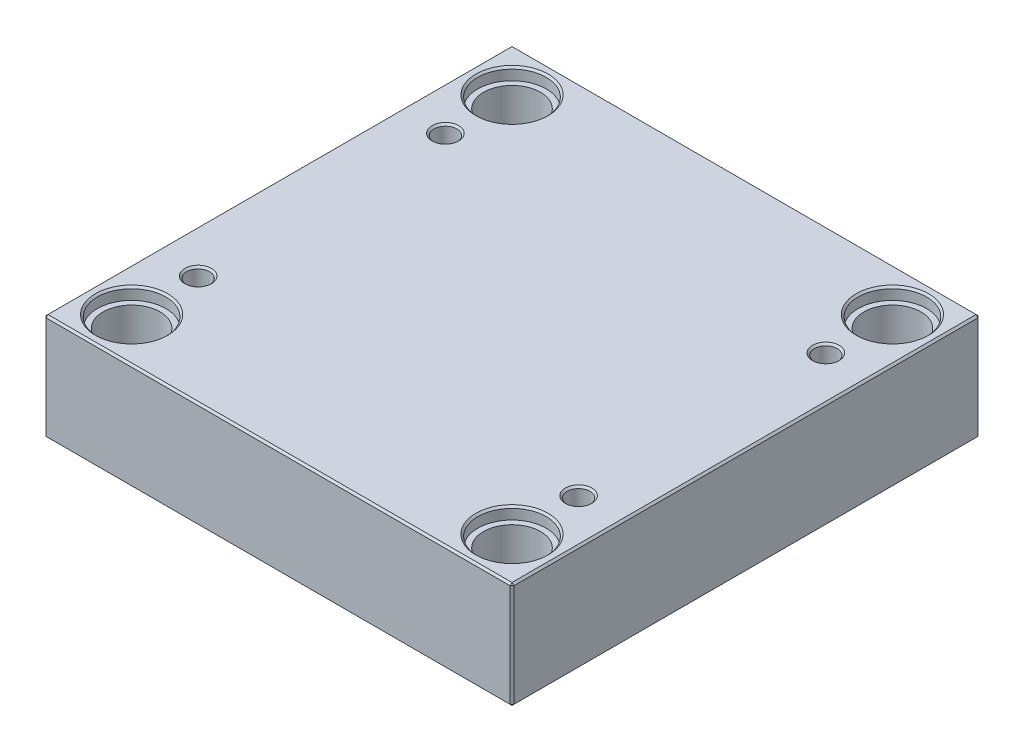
ISO-10303-21;
HEADER;
FILE_DESCRIPTION(('STEP AP214'),'2;1');
FILE_NAME('part.step','',(''),(''),'','','');
FILE_SCHEMA(('AUTOMOTIVE_DESIGN { 1 0 10303 214 1 1 1 1 }'));
ENDSEC;
DATA;
#1=APPLICATION_CONTEXT('core data for automotive mechanical design processes');
#2=APPLICATION_PROTOCOL_DEFINITION('international standard','automotive_design',2000,#1);
#3=PRODUCT_CONTEXT('',#1,'mechanical');
#4=PRODUCT('Part','Part','',(#3));
#5=PRODUCT_RELATED_PRODUCT_CATEGORY('part','',(#4));
#6=PRODUCT_DEFINITION_FORMATION('','',#4);
#7=PRODUCT_DEFINITION_CONTEXT('part definition',#1,'design');
#8=PRODUCT_DEFINITION('design','',#6,#7);
#9=PRODUCT_DEFINITION_SHAPE('','',#8);
#10=(LENGTH_UNIT() NAMED_UNIT(*) SI_UNIT(.MILLI.,.METRE.));
#11=(NAMED_UNIT(*) PLANE_ANGLE_UNIT() SI_UNIT($,.RADIAN.));
#12=(NAMED_UNIT(*) SI_UNIT($,.STERADIAN.) SOLID_ANGLE_UNIT());
#13=UNCERTAINTY_MEASURE_WITH_UNIT(LENGTH_MEASURE(1.E-05),#10,'distance_accuracy_value','');
#14=(GEOMETRIC_REPRESENTATION_CONTEXT(3) GLOBAL_UNCERTAINTY_ASSIGNED_CONTEXT((#13)) GLOBAL_UNIT_ASSIGNED_CONTEXT((#10,
#11,#12)) REPRESENTATION_CONTEXT('',''));
#15=CARTESIAN_POINT('',(0.,0.,0.));
#16=DIRECTION('',(0.,0.,1.));
#17=DIRECTION('',(1.,0.,0.));
#18=AXIS2_PLACEMENT_3D('',#15,#16,#17);
#19=CARTESIAN_POINT('',(-100.,0.,-100.));
#20=DIRECTION('',(0.,1.,0.));
#21=DIRECTION('',(0.,0.,1.));
#22=AXIS2_PLACEMENT_3D('',#19,#20,#21);
#23=CYLINDRICAL_SURFACE('',#22,15.);
#24=CARTESIAN_POINT('',(-100.,1.,-100.));
#25=DIRECTION('',(0.,1.,0.));
#26=DIRECTION('',(0.,0.,1.));
#27=AXIS2_PLACEMENT_3D('',#24,#25,#26);
#28=CIRCLE('',#27,15.);
#29=CARTESIAN_POINT('',(-100.,1.,-85.));
#30=VERTEX_POINT('',#29);
#31=EDGE_CURVE('E472',#30,#30,#28,.F.);
#32=ORIENTED_EDGE('',*,*,#31,.T.);
#33=EDGE_LOOP('',(#32));
#34=FACE_BOUND('',#33,.T.);
#35=CARTESIAN_POINT('',(-100.,49.7,-100.));
#36=DIRECTION('',(0.,1.,0.));
#37=DIRECTION('',(0.,0.,1.));
#38=AXIS2_PLACEMENT_3D('',#35,#36,#37);
#39=CIRCLE('',#38,15.);
#40=CARTESIAN_POINT('',(-100.,49.7,-85.));
#41=VERTEX_POINT('',#40);
#42=EDGE_CURVE('E221',#41,#41,#39,.F.);
#43=ORIENTED_EDGE('',*,*,#42,.F.);
#44=EDGE_LOOP('',(#43));
#45=FACE_BOUND('',#44,.T.);
#46=ADVANCED_FACE('F16',(#34,#45),#23,.F.);
#47=CARTESIAN_POINT('',(100.,0.,-100.));
#48=DIRECTION('',(0.,1.,0.));
#49=DIRECTION('',(0.,0.,1.));
#50=AXIS2_PLACEMENT_3D('',#47,#48,#49);
#51=CYLINDRICAL_SURFACE('',#50,15.);
#52=CARTESIAN_POINT('',(100.,1.,-100.));
#53=DIRECTION('',(0.,1.,0.));
#54=DIRECTION('',(0.,0.,1.));
#55=AXIS2_PLACEMENT_3D('',#52,#53,#54);
#56=CIRCLE('',#55,15.);
#57=CARTESIAN_POINT('',(100.,1.,-85.));
#58=VERTEX_POINT('',#57);
#59=EDGE_CURVE('E474',#58,#58,#56,.F.);
#60=ORIENTED_EDGE('',*,*,#59,.T.);
#61=EDGE_LOOP('',(#60));
#62=FACE_BOUND('',#61,.T.);
#63=CARTESIAN_POINT('',(100.,49.7,-100.));
#64=DIRECTION('',(0.,1.,0.));
#65=DIRECTION('',(0.,0.,1.));
#66=AXIS2_PLACEMENT_3D('',#63,#64,#65);
#67=CIRCLE('',#66,15.);
#68=CARTESIAN_POINT('',(100.,49.7,-85.));
#69=VERTEX_POINT('',#68);
#70=EDGE_CURVE('E218',#69,#69,#67,.F.);
#71=ORIENTED_EDGE('',*,*,#70,.F.);
#72=EDGE_LOOP('',(#71));
#73=FACE_BOUND('',#72,.T.);
#74=ADVANCED_FACE('F263',(#62,#73),#51,.F.);
#75=CARTESIAN_POINT('',(100.,0.,100.));
#76=DIRECTION('',(0.,1.,0.));
#77=DIRECTION('',(0.,0.,1.));
#78=AXIS2_PLACEMENT_3D('',#75,#76,#77);
#79=CYLINDRICAL_SURFACE('',#78,15.);
#80=CARTESIAN_POINT('',(100.,1.,100.));
#81=DIRECTION('',(0.,1.,0.));
#82=DIRECTION('',(0.,0.,1.));
#83=AXIS2_PLACEMENT_3D('',#80,#81,#82);
#84=CIRCLE('',#83,15.);
#85=CARTESIAN_POINT('',(100.,1.,115.));
#86=VERTEX_POINT('',#85);
#87=EDGE_CURVE('E477',#86,#86,#84,.F.);
#88=ORIENTED_EDGE('',*,*,#87,.T.);
#89=EDGE_LOOP('',(#88));
#90=FACE_BOUND('',#89,.T.);
#91=CARTESIAN_POINT('',(100.,49.7,100.));
#92=DIRECTION('',(0.,1.,0.));
#93=DIRECTION('',(0.,0.,1.));
#94=AXIS2_PLACEMENT_3D('',#91,#92,#93);
#95=CIRCLE('',#94,15.);
#96=CARTESIAN_POINT('',(100.,49.7,115.));
#97=VERTEX_POINT('',#96);
#98=EDGE_CURVE('E214',#97,#97,#95,.F.);
#99=ORIENTED_EDGE('',*,*,#98,.F.);
#100=EDGE_LOOP('',(#99));
#101=FACE_BOUND('',#100,.T.);
#102=ADVANCED_FACE('F270',(#90,#101),#79,.F.);
#103=CARTESIAN_POINT('',(-100.,0.,100.));
#104=DIRECTION('',(0.,1.,0.));
#105=DIRECTION('',(0.,0.,1.));
#106=AXIS2_PLACEMENT_3D('',#103,#104,#105);
#107=CYLINDRICAL_SURFACE('',#106,15.);
#108=CARTESIAN_POINT('',(-100.,1.,100.));
#109=DIRECTION('',(0.,1.,0.));
#110=DIRECTION('',(0.,0.,1.));
#111=AXIS2_PLACEMENT_3D('',#108,#109,#110);
#112=CIRCLE('',#111,15.);
#113=CARTESIAN_POINT('',(-100.,1.,115.));
#114=VERTEX_POINT('',#113);
#115=EDGE_CURVE('E480',#114,#114,#112,.F.);
#116=ORIENTED_EDGE('',*,*,#115,.T.);
#117=EDGE_LOOP('',(#116));
#118=FACE_BOUND('',#117,.T.);
#119=CARTESIAN_POINT('',(-100.,49.7,100.));
#120=DIRECTION('',(0.,1.,0.));
#121=DIRECTION('',(0.,0.,1.));
#122=AXIS2_PLACEMENT_3D('',#119,#120,#121);
#123=CIRCLE('',#122,15.);
#124=CARTESIAN_POINT('',(-100.,49.7,115.));
#125=VERTEX_POINT('',#124);
#126=EDGE_CURVE('E211',#125,#125,#123,.F.);
#127=ORIENTED_EDGE('',*,*,#126,.F.);
#128=EDGE_LOOP('',(#127));
#129=FACE_BOUND('',#128,.T.);
#130=ADVANCED_FACE('F277',(#118,#129),#107,.F.);
#131=CARTESIAN_POINT('',(-123.,56.,123.));
#132=DIRECTION('',(1.,0.,0.));
#133=DIRECTION('',(0.,0.,-1.));
#134=AXIS2_PLACEMENT_3D('',#131,#132,#133);
#135=PLANE('',#134);
#136=DIRECTION('',(0.,-1.,0.));
#137=VECTOR('',#136,1.);
#138=CARTESIAN_POINT('',(-123.,56.,-122.));
#139=LINE('',#138,#137);
#140=CARTESIAN_POINT('',(-123.,55.,-122.));
#141=VERTEX_POINT('',#140);
#142=CARTESIAN_POINT('',(-123.,1.,-122.));
#143=VERTEX_POINT('',#142);
#144=EDGE_CURVE('E487',#141,#143,#139,.T.);
#145=ORIENTED_EDGE('',*,*,#144,.T.);
#146=DIRECTION('',(0.,0.,1.));
#147=VECTOR('',#146,1.);
#148=CARTESIAN_POINT('',(-123.,1.,123.));
#149=LINE('',#148,#147);
#150=CARTESIAN_POINT('',(-123.,1.,122.));
#151=VERTEX_POINT('',#150);
#152=EDGE_CURVE('E490',#143,#151,#149,.T.);
#153=ORIENTED_EDGE('',*,*,#152,.T.);
#154=DIRECTION('',(0.,1.,0.));
#155=VECTOR('',#154,1.);
#156=CARTESIAN_POINT('',(-123.,56.,122.));
#157=LINE('',#156,#155);
#158=CARTESIAN_POINT('',(-123.,55.,122.));
#159=VERTEX_POINT('',#158);
#160=EDGE_CURVE('E485',#151,#159,#157,.T.);
#161=ORIENTED_EDGE('',*,*,#160,.T.);
#162=DIRECTION('',(0.,0.,-1.));
#163=VECTOR('',#162,1.);
#164=CARTESIAN_POINT('',(-123.,55.,-123.));
#165=LINE('',#164,#163);
#166=EDGE_CURVE('E483',#159,#141,#165,.T.);
#167=ORIENTED_EDGE('',*,*,#166,.T.);
#168=EDGE_LOOP('',(#145,#153,#161,#167));
#169=FACE_BOUND('',#168,.T.);
#170=ADVANCED_FACE('F298',(#169),#135,.F.);
#171=CARTESIAN_POINT('',(123.,56.,123.));
#172=DIRECTION('',(0.,0.,-1.));
#173=DIRECTION('',(-1.,0.,0.));
#174=AXIS2_PLACEMENT_3D('',#171,#172,#173);
#175=PLANE('',#174);
#176=DIRECTION('',(-1.,0.,0.));
#177=VECTOR('',#176,1.);
#178=CARTESIAN_POINT('',(-123.,55.,123.));
#179=LINE('',#178,#177);
#180=CARTESIAN_POINT('',(122.,55.,123.));
#181=VERTEX_POINT('',#180);
#182=CARTESIAN_POINT('',(-122.,55.,123.));
#183=VERTEX_POINT('',#182);
#184=EDGE_CURVE('E509',#181,#183,#179,.T.);
#185=ORIENTED_EDGE('',*,*,#184,.T.);
#186=DIRECTION('',(0.,-1.,0.));
#187=VECTOR('',#186,1.);
#188=CARTESIAN_POINT('',(-122.,56.,123.));
#189=LINE('',#188,#187);
#190=CARTESIAN_POINT('',(-122.,0.999999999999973,123.));
#191=VERTEX_POINT('',#190);
#192=EDGE_CURVE('E515',#183,#191,#189,.T.);
#193=ORIENTED_EDGE('',*,*,#192,.T.);
#194=DIRECTION('',(1.,0.,0.));
#195=VECTOR('',#194,1.);
#196=CARTESIAN_POINT('',(123.,0.999999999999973,123.));
#197=LINE('',#196,#195);
#198=CARTESIAN_POINT('',(122.,0.999999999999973,123.));
#199=VERTEX_POINT('',#198);
#200=EDGE_CURVE('E513',#191,#199,#197,.T.);
#201=ORIENTED_EDGE('',*,*,#200,.T.);
#202=DIRECTION('',(0.,1.,0.));
#203=VECTOR('',#202,1.);
#204=CARTESIAN_POINT('',(122.,56.,123.));
#205=LINE('',#204,#203);
#206=EDGE_CURVE('E511',#199,#181,#205,.T.);
#207=ORIENTED_EDGE('',*,*,#206,.T.);
#208=EDGE_LOOP('',(#185,#193,#201,#207));
#209=FACE_BOUND('',#208,.T.);
#210=ADVANCED_FACE('F294',(#209),#175,.F.);
#211=CARTESIAN_POINT('',(123.,56.,123.));
#212=DIRECTION('',(-1.,0.,0.));
#213=DIRECTION('',(0.,0.,1.));
#214=AXIS2_PLACEMENT_3D('',#211,#212,#213);
#215=PLANE('',#214);
#216=DIRECTION('',(0.,0.,-1.));
#217=VECTOR('',#216,1.);
#218=CARTESIAN_POINT('',(123.,0.999999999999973,123.));
#219=LINE('',#218,#217);
#220=CARTESIAN_POINT('',(123.,0.999999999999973,122.));
#221=VERTEX_POINT('',#220);
#222=CARTESIAN_POINT('',(123.,0.999999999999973,-122.));
#223=VERTEX_POINT('',#222);
#224=EDGE_CURVE('E504',#221,#223,#219,.T.);
#225=ORIENTED_EDGE('',*,*,#224,.T.);
#226=DIRECTION('',(0.,1.,0.));
#227=VECTOR('',#226,1.);
#228=CARTESIAN_POINT('',(123.,56.,-122.));
#229=LINE('',#228,#227);
#230=CARTESIAN_POINT('',(123.,55.,-122.));
#231=VERTEX_POINT('',#230);
#232=EDGE_CURVE('E506',#223,#231,#229,.T.);
#233=ORIENTED_EDGE('',*,*,#232,.T.);
#234=DIRECTION('',(0.,0.,1.));
#235=VECTOR('',#234,1.);
#236=CARTESIAN_POINT('',(123.,55.,123.));
#237=LINE('',#236,#235);
#238=CARTESIAN_POINT('',(123.,55.,122.));
#239=VERTEX_POINT('',#238);
#240=EDGE_CURVE('E500',#231,#239,#237,.T.);
#241=ORIENTED_EDGE('',*,*,#240,.T.);
#242=DIRECTION('',(0.,-1.,0.));
#243=VECTOR('',#242,1.);
#244=CARTESIAN_POINT('',(123.,56.,122.));
#245=LINE('',#244,#243);
#246=EDGE_CURVE('E502',#239,#221,#245,.T.);
#247=ORIENTED_EDGE('',*,*,#246,.T.);
#248=EDGE_LOOP('',(#225,#233,#241,#247));
#249=FACE_BOUND('',#248,.T.);
#250=ADVANCED_FACE('F290',(#249),#215,.F.);
#251=CARTESIAN_POINT('',(123.,56.,-123.));
#252=DIRECTION('',(0.,0.,1.));
#253=DIRECTION('',(1.,0.,0.));
#254=AXIS2_PLACEMENT_3D('',#251,#252,#253);
#255=PLANE('',#254);
#256=DIRECTION('',(0.,-1.,0.));
#257=VECTOR('',#256,1.);
#258=CARTESIAN_POINT('',(122.,56.,-123.));
#259=LINE('',#258,#257);
#260=CARTESIAN_POINT('',(122.,55.,-123.));
#261=VERTEX_POINT('',#260);
#262=CARTESIAN_POINT('',(122.,0.999999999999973,-123.));
#263=VERTEX_POINT('',#262);
#264=EDGE_CURVE('E494',#261,#263,#259,.T.);
#265=ORIENTED_EDGE('',*,*,#264,.T.);
#266=DIRECTION('',(-1.,0.,0.));
#267=VECTOR('',#266,1.);
#268=CARTESIAN_POINT('',(123.,0.999999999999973,-123.));
#269=LINE('',#268,#267);
#270=CARTESIAN_POINT('',(-122.,0.999999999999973,-123.));
#271=VERTEX_POINT('',#270);
#272=EDGE_CURVE('E138',#263,#271,#269,.T.);
#273=ORIENTED_EDGE('',*,*,#272,.T.);
#274=DIRECTION('',(0.,1.,0.));
#275=VECTOR('',#274,1.);
#276=CARTESIAN_POINT('',(-122.,56.,-123.));
#277=LINE('',#276,#275);
#278=CARTESIAN_POINT('',(-122.,55.,-123.));
#279=VERTEX_POINT('',#278);
#280=EDGE_CURVE('E496',#271,#279,#277,.T.);
#281=ORIENTED_EDGE('',*,*,#280,.T.);
#282=DIRECTION('',(1.,0.,0.));
#283=VECTOR('',#282,1.);
#284=CARTESIAN_POINT('',(123.,55.,-123.));
#285=LINE('',#284,#283);
#286=EDGE_CURVE('E492',#279,#261,#285,.T.);
#287=ORIENTED_EDGE('',*,*,#286,.T.);
#288=EDGE_LOOP('',(#265,#273,#281,#287));
#289=FACE_BOUND('',#288,.T.);
#290=ADVANCED_FACE('F282',(#289),#255,.F.);
#291=CARTESIAN_POINT('',(0.,56.,0.));
#292=DIRECTION('',(0.,1.,0.));
#293=DIRECTION('',(0.,0.,1.));
#294=AXIS2_PLACEMENT_3D('',#291,#292,#293);
#295=PLANE('',#294);
#296=CARTESIAN_POINT('',(100.,56.,100.));
#297=DIRECTION('',(0.,1.,0.));
#298=DIRECTION('',(0.,0.,1.));
#299=AXIS2_PLACEMENT_3D('',#296,#297,#298);
#300=CIRCLE('',#299,19.);
#301=CARTESIAN_POINT('',(100.,56.,119.));
#302=VERTEX_POINT('',#301);
#303=EDGE_CURVE('E236',#302,#302,#300,.F.);
#304=ORIENTED_EDGE('',*,*,#303,.T.);
#305=EDGE_LOOP('',(#304));
#306=FACE_BOUND('',#305,.T.);
#307=CARTESIAN_POINT('',(-100.,56.,100.));
#308=DIRECTION('',(0.,1.,0.));
#309=DIRECTION('',(0.,0.,1.));
#310=AXIS2_PLACEMENT_3D('',#307,#308,#309);
#311=CIRCLE('',#310,19.);
#312=CARTESIAN_POINT('',(-100.,56.,119.));
#313=VERTEX_POINT('',#312);
#314=EDGE_CURVE('E233',#313,#313,#311,.F.);
#315=ORIENTED_EDGE('',*,*,#314,.T.);
#316=EDGE_LOOP('',(#315));
#317=FACE_BOUND('',#316,.T.);
#318=CARTESIAN_POINT('',(100.,56.,-100.));
#319=DIRECTION('',(0.,1.,0.));
#320=DIRECTION('',(0.,0.,1.));
#321=AXIS2_PLACEMENT_3D('',#318,#319,#320);
#322=CIRCLE('',#321,19.);
#323=CARTESIAN_POINT('',(100.,56.,-81.));
#324=VERTEX_POINT('',#323);
#325=EDGE_CURVE('E230',#324,#324,#322,.F.);
#326=ORIENTED_EDGE('',*,*,#325,.T.);
#327=EDGE_LOOP('',(#326));
#328=FACE_BOUND('',#327,.T.);
#329=CARTESIAN_POINT('',(-100.,56.,-100.));
#330=DIRECTION('',(0.,1.,0.));
#331=DIRECTION('',(0.,0.,1.));
#332=AXIS2_PLACEMENT_3D('',#329,#330,#331);
#333=CIRCLE('',#332,19.);
#334=CARTESIAN_POINT('',(-100.,56.,-81.));
#335=VERTEX_POINT('',#334);
#336=EDGE_CURVE('E227',#335,#335,#333,.F.);
#337=ORIENTED_EDGE('',*,*,#336,.T.);
#338=EDGE_LOOP('',(#337));
#339=FACE_BOUND('',#338,.T.);
#340=CARTESIAN_POINT('',(-100.,56.,65.));
#341=DIRECTION('',(0.,1.,0.));
#342=DIRECTION('',(0.,0.,1.));
#343=AXIS2_PLACEMENT_3D('',#340,#341,#342);
#344=CIRCLE('',#343,7.);
#345=CARTESIAN_POINT('',(-100.,56.,72.));
#346=VERTEX_POINT('',#345);
#347=EDGE_CURVE('E198',#346,#346,#344,.F.);
#348=ORIENTED_EDGE('',*,*,#347,.T.);
#349=EDGE_LOOP('',(#348));
#350=FACE_BOUND('',#349,.T.);
#351=CARTESIAN_POINT('',(100.,56.,65.));
#352=DIRECTION('',(0.,1.,0.));
#353=DIRECTION('',(0.,0.,1.));
#354=AXIS2_PLACEMENT_3D('',#351,#352,#353);
#355=CIRCLE('',#354,7.);
#356=CARTESIAN_POINT('',(100.,56.,72.));
#357=VERTEX_POINT('',#356);
#358=EDGE_CURVE('E195',#357,#357,#355,.F.);
#359=ORIENTED_EDGE('',*,*,#358,.T.);
#360=EDGE_LOOP('',(#359));
#361=FACE_BOUND('',#360,.T.);
#362=CARTESIAN_POINT('',(100.,56.,-65.));
#363=DIRECTION('',(0.,1.,0.));
#364=DIRECTION('',(0.,0.,1.));
#365=AXIS2_PLACEMENT_3D('',#362,#363,#364);
#366=CIRCLE('',#365,7.);
#367=CARTESIAN_POINT('',(100.,56.,-58.));
#368=VERTEX_POINT('',#367);
#369=EDGE_CURVE('E192',#368,#368,#366,.F.);
#370=ORIENTED_EDGE('',*,*,#369,.T.);
#371=EDGE_LOOP('',(#370));
#372=FACE_BOUND('',#371,.T.);
#373=CARTESIAN_POINT('',(-100.,56.,-65.));
#374=DIRECTION('',(0.,1.,0.));
#375=DIRECTION('',(0.,0.,1.));
#376=AXIS2_PLACEMENT_3D('',#373,#374,#375);
#377=CIRCLE('',#376,7.);
#378=CARTESIAN_POINT('',(-100.,56.,-58.));
#379=VERTEX_POINT('',#378);
#380=EDGE_CURVE('E188',#379,#379,#377,.F.);
#381=ORIENTED_EDGE('',*,*,#380,.T.);
#382=EDGE_LOOP('',(#381));
#383=FACE_BOUND('',#382,.T.);
#384=DIRECTION('',(0.,0.,-1.));
#385=VECTOR('',#384,1.);
#386=CARTESIAN_POINT('',(122.,56.,-123.));
#387=LINE('',#386,#385);
#388=CARTESIAN_POINT('',(122.,56.,122.));
#389=VERTEX_POINT('',#388);
#390=CARTESIAN_POINT('',(122.,56.,-122.));
#391=VERTEX_POINT('',#390);
#392=EDGE_CURVE('E31',#389,#391,#387,.T.);
#393=ORIENTED_EDGE('',*,*,#392,.T.);
#394=DIRECTION('',(-1.,0.,0.));
#395=VECTOR('',#394,1.);
#396=CARTESIAN_POINT('',(-123.,56.,-122.));
#397=LINE('',#396,#395);
#398=CARTESIAN_POINT('',(-122.,56.,-122.));
#399=VERTEX_POINT('',#398);
#400=EDGE_CURVE('E189',#391,#399,#397,.T.);
#401=ORIENTED_EDGE('',*,*,#400,.T.);
#402=DIRECTION('',(0.,0.,1.));
#403=VECTOR('',#402,1.);
#404=CARTESIAN_POINT('',(-122.,56.,123.));
#405=LINE('',#404,#403);
#406=CARTESIAN_POINT('',(-122.,56.,122.));
#407=VERTEX_POINT('',#406);
#408=EDGE_CURVE('E518',#399,#407,#405,.T.);
#409=ORIENTED_EDGE('',*,*,#408,.T.);
#410=DIRECTION('',(1.,0.,0.));
#411=VECTOR('',#410,1.);
#412=CARTESIAN_POINT('',(123.,56.,122.));
#413=LINE('',#412,#411);
#414=EDGE_CURVE('E36',#407,#389,#413,.T.);
#415=ORIENTED_EDGE('',*,*,#414,.T.);
#416=EDGE_LOOP('',(#393,#401,#409,#415));
#417=FACE_BOUND('',#416,.T.);
#418=ADVANCED_FACE('F279',(#306,#317,#328,#339,#350,#361,#372,#383,#417),#295,.T.);
#419=CARTESIAN_POINT('',(0.,0.,0.));
#420=DIRECTION('',(0.,1.,0.));
#421=DIRECTION('',(0.,0.,1.));
#422=AXIS2_PLACEMENT_3D('',#419,#420,#421);
#423=PLANE('',#422);
#424=CARTESIAN_POINT('',(-100.,0.,-100.));
#425=DIRECTION('',(0.,1.,0.));
#426=DIRECTION('',(0.,0.,1.));
#427=AXIS2_PLACEMENT_3D('',#424,#425,#426);
#428=CIRCLE('',#427,16.);
#429=CARTESIAN_POINT('',(-100.,0.,-84.));
#430=VERTEX_POINT('',#429);
#431=EDGE_CURVE('E469',#430,#430,#428,.T.);
#432=ORIENTED_EDGE('',*,*,#431,.T.);
#433=EDGE_LOOP('',(#432));
#434=FACE_BOUND('',#433,.T.);
#435=CARTESIAN_POINT('',(100.,0.,-100.));
#436=DIRECTION('',(0.,1.,0.));
#437=DIRECTION('',(0.,0.,1.));
#438=AXIS2_PLACEMENT_3D('',#435,#436,#437);
#439=CIRCLE('',#438,16.);
#440=CARTESIAN_POINT('',(100.,0.,-84.));
#441=VERTEX_POINT('',#440);
#442=EDGE_CURVE('E466',#441,#441,#439,.T.);
#443=ORIENTED_EDGE('',*,*,#442,.T.);
#444=EDGE_LOOP('',(#443));
#445=FACE_BOUND('',#444,.T.);
#446=CARTESIAN_POINT('',(100.,0.,100.));
#447=DIRECTION('',(0.,1.,0.));
#448=DIRECTION('',(0.,0.,1.));
#449=AXIS2_PLACEMENT_3D('',#446,#447,#448);
#450=CIRCLE('',#449,16.);
#451=CARTESIAN_POINT('',(100.,0.,116.));
#452=VERTEX_POINT('',#451);
#453=EDGE_CURVE('E463',#452,#452,#450,.T.);
#454=ORIENTED_EDGE('',*,*,#453,.T.);
#455=EDGE_LOOP('',(#454));
#456=FACE_BOUND('',#455,.T.);
#457=CARTESIAN_POINT('',(-100.,0.,100.));
#458=DIRECTION('',(0.,1.,0.));
#459=DIRECTION('',(0.,0.,1.));
#460=AXIS2_PLACEMENT_3D('',#457,#458,#459);
#461=CIRCLE('',#460,16.);
#462=CARTESIAN_POINT('',(-100.,0.,116.));
#463=VERTEX_POINT('',#462);
#464=EDGE_CURVE('E460',#463,#463,#461,.T.);
#465=ORIENTED_EDGE('',*,*,#464,.T.);
#466=EDGE_LOOP('',(#465));
#467=FACE_BOUND('',#466,.T.);
#468=DIRECTION('',(0.,0.,1.));
#469=VECTOR('',#468,1.);
#470=CARTESIAN_POINT('',(122.,0.,0.));
#471=LINE('',#470,#469);
#472=CARTESIAN_POINT('',(122.,0.,-122.));
#473=VERTEX_POINT('',#472);
#474=CARTESIAN_POINT('',(122.,0.,122.));
#475=VERTEX_POINT('',#474);
#476=EDGE_CURVE('E108',#473,#475,#471,.T.);
#477=ORIENTED_EDGE('',*,*,#476,.T.);
#478=DIRECTION('',(-1.,0.,0.));
#479=VECTOR('',#478,1.);
#480=CARTESIAN_POINT('',(0.,0.,122.));
#481=LINE('',#480,#479);
#482=CARTESIAN_POINT('',(-122.,0.,122.));
#483=VERTEX_POINT('',#482);
#484=EDGE_CURVE('E458',#475,#483,#481,.T.);
#485=ORIENTED_EDGE('',*,*,#484,.T.);
#486=DIRECTION('',(0.,0.,-1.));
#487=VECTOR('',#486,1.);
#488=CARTESIAN_POINT('',(-122.,0.,0.));
#489=LINE('',#488,#487);
#490=CARTESIAN_POINT('',(-122.,0.,-122.));
#491=VERTEX_POINT('',#490);
#492=EDGE_CURVE('E110',#483,#491,#489,.T.);
#493=ORIENTED_EDGE('',*,*,#492,.T.);
#494=DIRECTION('',(1.,0.,0.));
#495=VECTOR('',#494,1.);
#496=CARTESIAN_POINT('',(0.,0.,-122.));
#497=LINE('',#496,#495);
#498=EDGE_CURVE('E104',#491,#473,#497,.T.);
#499=ORIENTED_EDGE('',*,*,#498,.T.);
#500=EDGE_LOOP('',(#477,#485,#493,#499));
#501=FACE_BOUND('',#500,.T.);
#502=ADVANCED_FACE('F106',(#434,#445,#456,#467,#501),#423,.F.);
#503=CARTESIAN_POINT('',(-100.,0.,-100.));
#504=DIRECTION('',(0.,-1.,0.));
#505=DIRECTION('',(0.,0.,-1.));
#506=AXIS2_PLACEMENT_3D('',#503,#504,#505);
#507=CONICAL_SURFACE('',#506,16.,0.785398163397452);
#508=ORIENTED_EDGE('',*,*,#31,.F.);
#509=EDGE_LOOP('',(#508));
#510=FACE_BOUND('',#509,.T.);
#511=ORIENTED_EDGE('',*,*,#431,.F.);
#512=EDGE_LOOP('',(#511));
#513=FACE_BOUND('',#512,.T.);
#514=ADVANCED_FACE('F286',(#510,#513),#507,.F.);
#515=CARTESIAN_POINT('',(100.,0.,-100.));
#516=DIRECTION('',(0.,-1.,0.));
#517=DIRECTION('',(0.,0.,-1.));
#518=AXIS2_PLACEMENT_3D('',#515,#516,#517);
#519=CONICAL_SURFACE('',#518,16.,0.785398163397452);
#520=ORIENTED_EDGE('',*,*,#59,.F.);
#521=EDGE_LOOP('',(#520));
#522=FACE_BOUND('',#521,.T.);
#523=ORIENTED_EDGE('',*,*,#442,.F.);
#524=EDGE_LOOP('',(#523));
#525=FACE_BOUND('',#524,.T.);
#526=ADVANCED_FACE('F305',(#522,#525),#519,.F.);
#527=CARTESIAN_POINT('',(100.,0.,100.));
#528=DIRECTION('',(0.,-1.,0.));
#529=DIRECTION('',(0.,0.,-1.));
#530=AXIS2_PLACEMENT_3D('',#527,#528,#529);
#531=CONICAL_SURFACE('',#530,16.,0.785398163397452);
#532=ORIENTED_EDGE('',*,*,#87,.F.);
#533=EDGE_LOOP('',(#532));
#534=FACE_BOUND('',#533,.T.);
#535=ORIENTED_EDGE('',*,*,#453,.F.);
#536=EDGE_LOOP('',(#535));
#537=FACE_BOUND('',#536,.T.);
#538=ADVANCED_FACE('F309',(#534,#537),#531,.F.);
#539=CARTESIAN_POINT('',(-100.,0.,100.));
#540=DIRECTION('',(0.,-1.,0.));
#541=DIRECTION('',(0.,0.,-1.));
#542=AXIS2_PLACEMENT_3D('',#539,#540,#541);
#543=CONICAL_SURFACE('',#542,16.,0.785398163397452);
#544=ORIENTED_EDGE('',*,*,#115,.F.);
#545=EDGE_LOOP('',(#544));
#546=FACE_BOUND('',#545,.T.);
#547=ORIENTED_EDGE('',*,*,#464,.F.);
#548=EDGE_LOOP('',(#547));
#549=FACE_BOUND('',#548,.T.);
#550=ADVANCED_FACE('F313',(#546,#549),#543,.F.);
#551=CARTESIAN_POINT('',(123.,56.,122.));
#552=DIRECTION('',(-0.707106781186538,0.,-0.707106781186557));
#553=DIRECTION('',(0.,-1.,0.));
#554=AXIS2_PLACEMENT_3D('',#551,#552,#553);
#555=PLANE('',#554);
#556=DIRECTION('',(-0.707106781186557,0.,0.707106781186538));
#557=VECTOR('',#556,1.);
#558=CARTESIAN_POINT('',(122.,55.,123.));
#559=LINE('',#558,#557);
#560=EDGE_CURVE('E126',#181,#239,#559,.F.);
#561=ORIENTED_EDGE('',*,*,#560,.F.);
#562=ORIENTED_EDGE('',*,*,#206,.F.);
#563=DIRECTION('',(0.707106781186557,0.,-0.707106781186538));
#564=VECTOR('',#563,1.);
#565=CARTESIAN_POINT('',(122.,0.999999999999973,123.));
#566=LINE('',#565,#564);
#567=EDGE_CURVE('E180',#221,#199,#566,.F.);
#568=ORIENTED_EDGE('',*,*,#567,.F.);
#569=ORIENTED_EDGE('',*,*,#246,.F.);
#570=EDGE_LOOP('',(#561,#562,#568,#569));
#571=FACE_BOUND('',#570,.T.);
#572=ADVANCED_FACE('F317',(#571),#555,.F.);
#573=CARTESIAN_POINT('',(122.,55.,123.));
#574=DIRECTION('',(0.577350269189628,0.577350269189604,0.577350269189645));
#575=DIRECTION('',(0.707106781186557,0.,-0.707106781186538));
#576=AXIS2_PLACEMENT_3D('',#573,#574,#575);
#577=PLANE('',#576);
#578=DIRECTION('',(0.,-0.70710678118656,0.707106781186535));
#579=VECTOR('',#578,1.);
#580=CARTESIAN_POINT('',(122.,55.,123.));
#581=LINE('',#580,#579);
#582=EDGE_CURVE('E175',#181,#389,#581,.F.);
#583=ORIENTED_EDGE('',*,*,#582,.F.);
#584=ORIENTED_EDGE('',*,*,#560,.T.);
#585=DIRECTION('',(-0.707106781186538,0.707106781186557,0.));
#586=VECTOR('',#585,1.);
#587=CARTESIAN_POINT('',(122.5,55.5,122.));
#588=LINE('',#587,#586);
#589=EDGE_CURVE('E177',#389,#239,#588,.F.);
#590=ORIENTED_EDGE('',*,*,#589,.F.);
#591=EDGE_LOOP('',(#583,#584,#590));
#592=FACE_BOUND('',#591,.T.);
#593=ADVANCED_FACE('F385',(#592),#577,.T.);
#594=CARTESIAN_POINT('',(122.,0.999999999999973,123.));
#595=DIRECTION('',(0.577350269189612,-0.577350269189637,0.577350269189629));
#596=DIRECTION('',(0.,-0.707106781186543,-0.707106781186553));
#597=AXIS2_PLACEMENT_3D('',#594,#595,#596);
#598=PLANE('',#597);
#599=DIRECTION('',(-0.707106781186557,-0.707106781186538,0.));
#600=VECTOR('',#599,1.);
#601=CARTESIAN_POINT('',(122.5,0.49999999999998,122.));
#602=LINE('',#601,#600);
#603=EDGE_CURVE('E124',#221,#475,#602,.T.);
#604=ORIENTED_EDGE('',*,*,#603,.F.);
#605=ORIENTED_EDGE('',*,*,#567,.T.);
#606=DIRECTION('',(0.,0.70710678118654,0.707106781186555));
#607=VECTOR('',#606,1.);
#608=CARTESIAN_POINT('',(122.,0.999999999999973,123.));
#609=LINE('',#608,#607);
#610=EDGE_CURVE('E172',#475,#199,#609,.T.);
#611=ORIENTED_EDGE('',*,*,#610,.F.);
#612=EDGE_LOOP('',(#604,#605,#611));
#613=FACE_BOUND('',#612,.T.);
#614=ADVANCED_FACE('F381',(#613),#598,.T.);
#615=CARTESIAN_POINT('',(122.,56.,0.));
#616=DIRECTION('',(0.707106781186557,0.707106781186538,0.));
#617=DIRECTION('',(0.,0.,1.));
#618=AXIS2_PLACEMENT_3D('',#615,#616,#617);
#619=PLANE('',#618);
#620=ORIENTED_EDGE('',*,*,#589,.T.);
#621=ORIENTED_EDGE('',*,*,#240,.F.);
#622=DIRECTION('',(0.707106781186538,-0.707106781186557,0.));
#623=VECTOR('',#622,1.);
#624=CARTESIAN_POINT('',(123.,55.,-122.));
#625=LINE('',#624,#623);
#626=EDGE_CURVE('E166',#391,#231,#625,.T.);
#627=ORIENTED_EDGE('',*,*,#626,.F.);
#628=ORIENTED_EDGE('',*,*,#392,.F.);
#629=EDGE_LOOP('',(#620,#621,#627,#628));
#630=FACE_BOUND('',#629,.T.);
#631=ADVANCED_FACE('F377',(#630),#619,.T.);
#632=CARTESIAN_POINT('',(0.,56.,122.));
#633=DIRECTION('',(0.,0.707106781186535,0.70710678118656));
#634=DIRECTION('',(-1.,0.,0.));
#635=AXIS2_PLACEMENT_3D('',#632,#633,#634);
#636=PLANE('',#635);
#637=ORIENTED_EDGE('',*,*,#582,.T.);
#638=ORIENTED_EDGE('',*,*,#414,.F.);
#639=DIRECTION('',(0.,0.70710678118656,-0.707106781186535));
#640=VECTOR('',#639,1.);
#641=CARTESIAN_POINT('',(-122.,55.5,122.5));
#642=LINE('',#641,#640);
#643=EDGE_CURVE('E163',#183,#407,#642,.T.);
#644=ORIENTED_EDGE('',*,*,#643,.F.);
#645=ORIENTED_EDGE('',*,*,#184,.F.);
#646=EDGE_LOOP('',(#637,#638,#644,#645));
#647=FACE_BOUND('',#646,.T.);
#648=ADVANCED_FACE('F373',(#647),#636,.T.);
#649=CARTESIAN_POINT('',(-122.,56.,123.));
#650=DIRECTION('',(0.707106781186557,0.,-0.707106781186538));
#651=DIRECTION('',(0.,-1.,0.));
#652=AXIS2_PLACEMENT_3D('',#649,#650,#651);
#653=PLANE('',#652);
#654=DIRECTION('',(0.707106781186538,0.,0.707106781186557));
#655=VECTOR('',#654,1.);
#656=CARTESIAN_POINT('',(-122.,0.999999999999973,123.));
#657=LINE('',#656,#655);
#658=EDGE_CURVE('E157',#191,#151,#657,.F.);
#659=ORIENTED_EDGE('',*,*,#658,.F.);
#660=ORIENTED_EDGE('',*,*,#192,.F.);
#661=DIRECTION('',(-0.707106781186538,0.,-0.707106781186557));
#662=VECTOR('',#661,1.);
#663=CARTESIAN_POINT('',(-123.,55.,122.));
#664=LINE('',#663,#662);
#665=EDGE_CURVE('E160',#159,#183,#664,.F.);
#666=ORIENTED_EDGE('',*,*,#665,.F.);
#667=ORIENTED_EDGE('',*,*,#160,.F.);
#668=EDGE_LOOP('',(#659,#660,#666,#667));
#669=FACE_BOUND('',#668,.T.);
#670=ADVANCED_FACE('F369',(#669),#653,.F.);
#671=CARTESIAN_POINT('',(123.,0.999999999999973,123.));
#672=DIRECTION('',(0.,0.707106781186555,-0.70710678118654));
#673=DIRECTION('',(1.,0.,0.));
#674=AXIS2_PLACEMENT_3D('',#671,#672,#673);
#675=PLANE('',#674);
#676=ORIENTED_EDGE('',*,*,#610,.T.);
#677=ORIENTED_EDGE('',*,*,#200,.F.);
#678=DIRECTION('',(0.,-0.70710678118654,-0.707106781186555));
#679=VECTOR('',#678,1.);
#680=CARTESIAN_POINT('',(-122.,0.999999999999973,123.));
#681=LINE('',#680,#679);
#682=EDGE_CURVE('E135',#483,#191,#681,.F.);
#683=ORIENTED_EDGE('',*,*,#682,.F.);
#684=ORIENTED_EDGE('',*,*,#484,.F.);
#685=EDGE_LOOP('',(#676,#677,#683,#684));
#686=FACE_BOUND('',#685,.T.);
#687=ADVANCED_FACE('F366',(#686),#675,.F.);
#688=CARTESIAN_POINT('',(123.,0.999999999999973,123.));
#689=DIRECTION('',(-0.707106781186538,0.707106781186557,0.));
#690=DIRECTION('',(0.,0.,-1.));
#691=AXIS2_PLACEMENT_3D('',#688,#689,#690);
#692=PLANE('',#691);
#693=ORIENTED_EDGE('',*,*,#603,.T.);
#694=ORIENTED_EDGE('',*,*,#476,.F.);
#695=DIRECTION('',(0.707106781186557,0.707106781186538,0.));
#696=VECTOR('',#695,1.);
#697=CARTESIAN_POINT('',(122.5,0.49999999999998,-122.));
#698=LINE('',#697,#696);
#699=EDGE_CURVE('E121',#223,#473,#698,.F.);
#700=ORIENTED_EDGE('',*,*,#699,.F.);
#701=ORIENTED_EDGE('',*,*,#224,.F.);
#702=EDGE_LOOP('',(#693,#694,#700,#701));
#703=FACE_BOUND('',#702,.T.);
#704=ADVANCED_FACE('F119',(#703),#692,.F.);
#705=CARTESIAN_POINT('',(122.,56.,-123.));
#706=DIRECTION('',(-0.707106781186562,0.,0.707106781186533));
#707=DIRECTION('',(0.,-1.,0.));
#708=AXIS2_PLACEMENT_3D('',#705,#706,#707);
#709=PLANE('',#708);
#710=DIRECTION('',(0.707106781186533,0.,0.707106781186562));
#711=VECTOR('',#710,1.);
#712=CARTESIAN_POINT('',(123.,55.,-122.));
#713=LINE('',#712,#711);
#714=EDGE_CURVE('E168',#231,#261,#713,.F.);
#715=ORIENTED_EDGE('',*,*,#714,.F.);
#716=ORIENTED_EDGE('',*,*,#232,.F.);
#717=DIRECTION('',(-0.707106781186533,0.,-0.707106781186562));
#718=VECTOR('',#717,1.);
#719=CARTESIAN_POINT('',(122.,0.999999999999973,-123.));
#720=LINE('',#719,#718);
#721=EDGE_CURVE('E134',#263,#223,#720,.F.);
#722=ORIENTED_EDGE('',*,*,#721,.F.);
#723=ORIENTED_EDGE('',*,*,#264,.F.);
#724=EDGE_LOOP('',(#715,#716,#722,#723));
#725=FACE_BOUND('',#724,.T.);
#726=ADVANCED_FACE('F359',(#725),#709,.F.);
#727=CARTESIAN_POINT('',(123.,55.,-122.));
#728=DIRECTION('',(0.577350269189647,0.577350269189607,-0.577350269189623));
#729=DIRECTION('',(-0.707106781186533,0.,-0.707106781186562));
#730=AXIS2_PLACEMENT_3D('',#727,#728,#729);
#731=PLANE('',#730);
#732=ORIENTED_EDGE('',*,*,#626,.T.);
#733=ORIENTED_EDGE('',*,*,#714,.T.);
#734=DIRECTION('',(0.,0.707106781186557,0.707106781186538));
#735=VECTOR('',#734,1.);
#736=CARTESIAN_POINT('',(122.,55.5,-122.5));
#737=LINE('',#736,#735);
#738=EDGE_CURVE('E152',#391,#261,#737,.F.);
#739=ORIENTED_EDGE('',*,*,#738,.F.);
#740=EDGE_LOOP('',(#732,#733,#739));
#741=FACE_BOUND('',#740,.T.);
#742=ADVANCED_FACE('F355',(#741),#731,.T.);
#743=CARTESIAN_POINT('',(-123.,55.,122.));
#744=DIRECTION('',(-0.577350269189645,0.577350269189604,0.577350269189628));
#745=DIRECTION('',(0.707106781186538,0.,0.707106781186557));
#746=AXIS2_PLACEMENT_3D('',#743,#744,#745);
#747=PLANE('',#746);
#748=ORIENTED_EDGE('',*,*,#665,.T.);
#749=ORIENTED_EDGE('',*,*,#643,.T.);
#750=DIRECTION('',(-0.707106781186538,-0.707106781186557,0.));
#751=VECTOR('',#750,1.);
#752=CARTESIAN_POINT('',(-123.,55.,122.));
#753=LINE('',#752,#751);
#754=EDGE_CURVE('E143',#159,#407,#753,.F.);
#755=ORIENTED_EDGE('',*,*,#754,.F.);
#756=EDGE_LOOP('',(#748,#749,#755));
#757=FACE_BOUND('',#756,.T.);
#758=ADVANCED_FACE('F351',(#757),#747,.T.);
#759=CARTESIAN_POINT('',(-122.,0.999999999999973,123.));
#760=DIRECTION('',(-0.577350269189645,-0.57735026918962,0.577350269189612));
#761=DIRECTION('',(0.707106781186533,-0.707106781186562,0.));
#762=AXIS2_PLACEMENT_3D('',#759,#760,#761);
#763=PLANE('',#762);
#764=ORIENTED_EDGE('',*,*,#682,.T.);
#765=ORIENTED_EDGE('',*,*,#658,.T.);
#766=DIRECTION('',(-0.707106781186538,0.707106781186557,0.));
#767=VECTOR('',#766,1.);
#768=CARTESIAN_POINT('',(-122.5,0.499999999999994,122.));
#769=LINE('',#768,#767);
#770=EDGE_CURVE('E139',#483,#151,#769,.T.);
#771=ORIENTED_EDGE('',*,*,#770,.F.);
#772=EDGE_LOOP('',(#764,#765,#771));
#773=FACE_BOUND('',#772,.T.);
#774=ADVANCED_FACE('F348',(#773),#763,.T.);
#775=CARTESIAN_POINT('',(122.,0.999999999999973,-123.));
#776=DIRECTION('',(0.577350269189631,-0.577350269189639,-0.577350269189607));
#777=DIRECTION('',(0.707106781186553,0.707106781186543,0.));
#778=AXIS2_PLACEMENT_3D('',#775,#776,#777);
#779=PLANE('',#778);
#780=ORIENTED_EDGE('',*,*,#721,.T.);
#781=ORIENTED_EDGE('',*,*,#699,.T.);
#782=DIRECTION('',(0.,-0.707106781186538,0.707106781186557));
#783=VECTOR('',#782,1.);
#784=CARTESIAN_POINT('',(122.,0.999999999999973,-123.));
#785=LINE('',#784,#783);
#786=EDGE_CURVE('E131',#263,#473,#785,.T.);
#787=ORIENTED_EDGE('',*,*,#786,.F.);
#788=EDGE_LOOP('',(#780,#781,#787));
#789=FACE_BOUND('',#788,.T.);
#790=ADVANCED_FACE('F130',(#789),#779,.T.);
#791=CARTESIAN_POINT('',(0.,56.,-122.));
#792=DIRECTION('',(0.,0.707106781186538,-0.707106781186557));
#793=DIRECTION('',(1.,0.,0.));
#794=AXIS2_PLACEMENT_3D('',#791,#792,#793);
#795=PLANE('',#794);
#796=ORIENTED_EDGE('',*,*,#738,.T.);
#797=ORIENTED_EDGE('',*,*,#286,.F.);
#798=DIRECTION('',(0.,-0.707106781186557,-0.707106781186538));
#799=VECTOR('',#798,1.);
#800=CARTESIAN_POINT('',(-122.,55.,-123.));
#801=LINE('',#800,#799);
#802=EDGE_CURVE('E140',#399,#279,#801,.T.);
#803=ORIENTED_EDGE('',*,*,#802,.F.);
#804=ORIENTED_EDGE('',*,*,#400,.F.);
#805=EDGE_LOOP('',(#796,#797,#803,#804));
#806=FACE_BOUND('',#805,.T.);
#807=ADVANCED_FACE('F341',(#806),#795,.T.);
#808=CARTESIAN_POINT('',(-122.,56.,0.));
#809=DIRECTION('',(-0.707106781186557,0.707106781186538,0.));
#810=DIRECTION('',(0.,0.,-1.));
#811=AXIS2_PLACEMENT_3D('',#808,#809,#810);
#812=PLANE('',#811);
#813=ORIENTED_EDGE('',*,*,#754,.T.);
#814=ORIENTED_EDGE('',*,*,#408,.F.);
#815=DIRECTION('',(0.707106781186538,0.707106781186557,0.));
#816=VECTOR('',#815,1.);
#817=CARTESIAN_POINT('',(-122.5,55.5,-122.));
#818=LINE('',#817,#816);
#819=EDGE_CURVE('E146',#141,#399,#818,.T.);
#820=ORIENTED_EDGE('',*,*,#819,.F.);
#821=ORIENTED_EDGE('',*,*,#166,.F.);
#822=EDGE_LOOP('',(#813,#814,#820,#821));
#823=FACE_BOUND('',#822,.T.);
#824=ADVANCED_FACE('F337',(#823),#812,.T.);
#825=CARTESIAN_POINT('',(-123.,1.,123.));
#826=DIRECTION('',(0.707106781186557,0.707106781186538,0.));
#827=DIRECTION('',(0.,0.,1.));
#828=AXIS2_PLACEMENT_3D('',#825,#826,#827);
#829=PLANE('',#828);
#830=ORIENTED_EDGE('',*,*,#770,.T.);
#831=ORIENTED_EDGE('',*,*,#152,.F.);
#832=DIRECTION('',(0.707106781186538,-0.707106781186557,0.));
#833=VECTOR('',#832,1.);
#834=CARTESIAN_POINT('',(-123.,1.,-122.));
#835=LINE('',#834,#833);
#836=EDGE_CURVE('E529',#491,#143,#835,.F.);
#837=ORIENTED_EDGE('',*,*,#836,.F.);
#838=ORIENTED_EDGE('',*,*,#492,.F.);
#839=EDGE_LOOP('',(#830,#831,#837,#838));
#840=FACE_BOUND('',#839,.T.);
#841=ADVANCED_FACE('F334',(#840),#829,.F.);
#842=CARTESIAN_POINT('',(123.,0.999999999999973,-123.));
#843=DIRECTION('',(0.,0.707106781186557,0.707106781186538));
#844=DIRECTION('',(-1.,0.,0.));
#845=AXIS2_PLACEMENT_3D('',#842,#843,#844);
#846=PLANE('',#845);
#847=ORIENTED_EDGE('',*,*,#786,.T.);
#848=ORIENTED_EDGE('',*,*,#498,.F.);
#849=DIRECTION('',(0.,0.707106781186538,-0.707106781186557));
#850=VECTOR('',#849,1.);
#851=CARTESIAN_POINT('',(-122.,0.499999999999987,-122.5));
#852=LINE('',#851,#850);
#853=EDGE_CURVE('E526',#271,#491,#852,.F.);
#854=ORIENTED_EDGE('',*,*,#853,.F.);
#855=ORIENTED_EDGE('',*,*,#272,.F.);
#856=EDGE_LOOP('',(#847,#848,#854,#855));
#857=FACE_BOUND('',#856,.T.);
#858=ADVANCED_FACE('F137',(#857),#846,.F.);
#859=CARTESIAN_POINT('',(-122.,55.,-123.));
#860=DIRECTION('',(-0.577350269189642,0.57735026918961,-0.577350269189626));
#861=DIRECTION('',(-0.707106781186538,0.,0.707106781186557));
#862=AXIS2_PLACEMENT_3D('',#859,#860,#861);
#863=PLANE('',#862);
#864=ORIENTED_EDGE('',*,*,#819,.T.);
#865=ORIENTED_EDGE('',*,*,#802,.T.);
#866=DIRECTION('',(0.707106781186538,0.,-0.707106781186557));
#867=VECTOR('',#866,1.);
#868=CARTESIAN_POINT('',(-122.,55.,-123.));
#869=LINE('',#868,#867);
#870=EDGE_CURVE('E524',#141,#279,#869,.T.);
#871=ORIENTED_EDGE('',*,*,#870,.F.);
#872=EDGE_LOOP('',(#864,#865,#871));
#873=FACE_BOUND('',#872,.T.);
#874=ADVANCED_FACE('F327',(#873),#863,.T.);
#875=CARTESIAN_POINT('',(-123.,1.,-122.));
#876=DIRECTION('',(-0.577350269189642,-0.577350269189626,-0.57735026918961));
#877=DIRECTION('',(0.707106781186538,-0.707106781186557,0.));
#878=AXIS2_PLACEMENT_3D('',#875,#876,#877);
#879=PLANE('',#878);
#880=ORIENTED_EDGE('',*,*,#853,.T.);
#881=ORIENTED_EDGE('',*,*,#836,.T.);
#882=DIRECTION('',(-0.707106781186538,0.,0.707106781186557));
#883=VECTOR('',#882,1.);
#884=CARTESIAN_POINT('',(-123.,1.,-122.));
#885=LINE('',#884,#883);
#886=EDGE_CURVE('E455',#271,#143,#885,.T.);
#887=ORIENTED_EDGE('',*,*,#886,.F.);
#888=EDGE_LOOP('',(#880,#881,#887));
#889=FACE_BOUND('',#888,.T.);
#890=ADVANCED_FACE('F323',(#889),#879,.T.);
#891=CARTESIAN_POINT('',(-123.,56.,-122.));
#892=DIRECTION('',(0.707106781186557,0.,0.707106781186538));
#893=DIRECTION('',(0.,-1.,0.));
#894=AXIS2_PLACEMENT_3D('',#891,#892,#893);
#895=PLANE('',#894);
#896=ORIENTED_EDGE('',*,*,#870,.T.);
#897=ORIENTED_EDGE('',*,*,#280,.F.);
#898=ORIENTED_EDGE('',*,*,#886,.T.);
#899=ORIENTED_EDGE('',*,*,#144,.F.);
#900=EDGE_LOOP('',(#896,#897,#898,#899));
#901=FACE_BOUND('',#900,.T.);
#902=ADVANCED_FACE('F319',(#901),#895,.F.);
#903=CARTESIAN_POINT('',(-100.,32.,-65.));
#904=DIRECTION('',(0.,1.,0.));
#905=DIRECTION('',(0.,0.,1.));
#906=AXIS2_PLACEMENT_3D('',#903,#904,#905);
#907=CYLINDRICAL_SURFACE('',#906,6.);
#908=CARTESIAN_POINT('',(-100.,55.,-65.));
#909=DIRECTION('',(0.,1.,0.));
#910=DIRECTION('',(0.,0.,1.));
#911=AXIS2_PLACEMENT_3D('',#908,#909,#910);
#912=CIRCLE('',#911,6.);
#913=CARTESIAN_POINT('',(-100.,55.,-59.));
#914=VERTEX_POINT('',#913);
#915=EDGE_CURVE('E207',#914,#914,#912,.T.);
#916=ORIENTED_EDGE('',*,*,#915,.T.);
#917=EDGE_LOOP('',(#916));
#918=FACE_BOUND('',#917,.T.);
#919=CARTESIAN_POINT('',(-100.,32.,-65.));
#920=DIRECTION('',(0.,1.,0.));
#921=DIRECTION('',(0.,0.,1.));
#922=AXIS2_PLACEMENT_3D('',#919,#920,#921);
#923=CIRCLE('',#922,6.);
#924=CARTESIAN_POINT('',(-100.,32.,-59.));
#925=VERTEX_POINT('',#924);
#926=EDGE_CURVE('E448',#925,#925,#923,.T.);
#927=ORIENTED_EDGE('',*,*,#926,.F.);
#928=EDGE_LOOP('',(#927));
#929=FACE_BOUND('',#928,.T.);
#930=ADVANCED_FACE('F322',(#918,#929),#907,.F.);
#931=CARTESIAN_POINT('',(-100.,32.,-65.));
#932=DIRECTION('',(0.,1.,0.));
#933=DIRECTION('',(0.,0.,1.));
#934=AXIS2_PLACEMENT_3D('',#931,#932,#933);
#935=PLANE('',#934);
#936=ORIENTED_EDGE('',*,*,#926,.T.);
#937=EDGE_LOOP('',(#936));
#938=FACE_BOUND('',#937,.T.);
#939=ADVANCED_FACE('F596',(#938),#935,.T.);
#940=CARTESIAN_POINT('',(100.,32.,-65.));
#941=DIRECTION('',(0.,1.,0.));
#942=DIRECTION('',(0.,0.,1.));
#943=AXIS2_PLACEMENT_3D('',#940,#941,#942);
#944=CYLINDRICAL_SURFACE('',#943,6.);
#945=CARTESIAN_POINT('',(100.,55.,-65.));
#946=DIRECTION('',(0.,1.,0.));
#947=DIRECTION('',(0.,0.,1.));
#948=AXIS2_PLACEMENT_3D('',#945,#946,#947);
#949=CIRCLE('',#948,6.);
#950=CARTESIAN_POINT('',(100.,55.,-59.));
#951=VERTEX_POINT('',#950);
#952=EDGE_CURVE('E204',#951,#951,#949,.T.);
#953=ORIENTED_EDGE('',*,*,#952,.T.);
#954=EDGE_LOOP('',(#953));
#955=FACE_BOUND('',#954,.T.);
#956=CARTESIAN_POINT('',(100.,32.,-65.));
#957=DIRECTION('',(0.,1.,0.));
#958=DIRECTION('',(0.,0.,1.));
#959=AXIS2_PLACEMENT_3D('',#956,#957,#958);
#960=CIRCLE('',#959,6.);
#961=CARTESIAN_POINT('',(100.,32.,-59.));
#962=VERTEX_POINT('',#961);
#963=EDGE_CURVE('E445',#962,#962,#960,.T.);
#964=ORIENTED_EDGE('',*,*,#963,.F.);
#965=EDGE_LOOP('',(#964));
#966=FACE_BOUND('',#965,.T.);
#967=ADVANCED_FACE('F592',(#955,#966),#944,.F.);
#968=CARTESIAN_POINT('',(100.,32.,-65.));
#969=DIRECTION('',(0.,1.,0.));
#970=DIRECTION('',(0.,0.,1.));
#971=AXIS2_PLACEMENT_3D('',#968,#969,#970);
#972=PLANE('',#971);
#973=ORIENTED_EDGE('',*,*,#963,.T.);
#974=EDGE_LOOP('',(#973));
#975=FACE_BOUND('',#974,.T.);
#976=ADVANCED_FACE('F588',(#975),#972,.T.);
#977=CARTESIAN_POINT('',(100.,32.,65.));
#978=DIRECTION('',(0.,1.,0.));
#979=DIRECTION('',(0.,0.,1.));
#980=AXIS2_PLACEMENT_3D('',#977,#978,#979);
#981=CYLINDRICAL_SURFACE('',#980,6.);
#982=CARTESIAN_POINT('',(100.,55.,65.));
#983=DIRECTION('',(0.,1.,0.));
#984=DIRECTION('',(0.,0.,1.));
#985=AXIS2_PLACEMENT_3D('',#982,#983,#984);
#986=CIRCLE('',#985,6.);
#987=CARTESIAN_POINT('',(100.,55.,71.));
#988=VERTEX_POINT('',#987);
#989=EDGE_CURVE('E201',#988,#988,#986,.T.);
#990=ORIENTED_EDGE('',*,*,#989,.T.);
#991=EDGE_LOOP('',(#990));
#992=FACE_BOUND('',#991,.T.);
#993=CARTESIAN_POINT('',(100.,32.,65.));
#994=DIRECTION('',(0.,1.,0.));
#995=DIRECTION('',(0.,0.,1.));
#996=AXIS2_PLACEMENT_3D('',#993,#994,#995);
#997=CIRCLE('',#996,6.);
#998=CARTESIAN_POINT('',(100.,32.,71.));
#999=VERTEX_POINT('',#998);
#1000=EDGE_CURVE('E449',#999,#999,#997,.T.);
#1001=ORIENTED_EDGE('',*,*,#1000,.F.);
#1002=EDGE_LOOP('',(#1001));
#1003=FACE_BOUND('',#1002,.T.);
#1004=ADVANCED_FACE('F591',(#992,#1003),#981,.F.);
#1005=CARTESIAN_POINT('',(100.,32.,65.));
#1006=DIRECTION('',(0.,1.,0.));
#1007=DIRECTION('',(0.,0.,1.));
#1008=AXIS2_PLACEMENT_3D('',#1005,#1006,#1007);
#1009=PLANE('',#1008);
#1010=ORIENTED_EDGE('',*,*,#1000,.T.);
#1011=EDGE_LOOP('',(#1010));
#1012=FACE_BOUND('',#1011,.T.);
#1013=ADVANCED_FACE('F598',(#1012),#1009,.T.);
#1014=CARTESIAN_POINT('',(-100.,32.,65.));
#1015=DIRECTION('',(0.,1.,0.));
#1016=DIRECTION('',(0.,0.,1.));
#1017=AXIS2_PLACEMENT_3D('',#1014,#1015,#1016);
#1018=CYLINDRICAL_SURFACE('',#1017,6.);
#1019=CARTESIAN_POINT('',(-100.,55.,65.));
#1020=DIRECTION('',(0.,1.,0.));
#1021=DIRECTION('',(0.,0.,1.));
#1022=AXIS2_PLACEMENT_3D('',#1019,#1020,#1021);
#1023=CIRCLE('',#1022,6.);
#1024=CARTESIAN_POINT('',(-100.,55.,71.));
#1025=VERTEX_POINT('',#1024);
#1026=EDGE_CURVE('E185',#1025,#1025,#1023,.T.);
#1027=ORIENTED_EDGE('',*,*,#1026,.T.);
#1028=EDGE_LOOP('',(#1027));
#1029=FACE_BOUND('',#1028,.T.);
#1030=CARTESIAN_POINT('',(-100.,32.,65.));
#1031=DIRECTION('',(0.,1.,0.));
#1032=DIRECTION('',(0.,0.,1.));
#1033=AXIS2_PLACEMENT_3D('',#1030,#1031,#1032);
#1034=CIRCLE('',#1033,6.);
#1035=CARTESIAN_POINT('',(-100.,32.,71.));
#1036=VERTEX_POINT('',#1035);
#1037=EDGE_CURVE('E224',#1036,#1036,#1034,.T.);
#1038=ORIENTED_EDGE('',*,*,#1037,.F.);
#1039=EDGE_LOOP('',(#1038));
#1040=FACE_BOUND('',#1039,.T.);
#1041=ADVANCED_FACE('F601',(#1029,#1040),#1018,.F.);
#1042=CARTESIAN_POINT('',(-100.,32.,65.));
#1043=DIRECTION('',(0.,1.,0.));
#1044=DIRECTION('',(0.,0.,1.));
#1045=AXIS2_PLACEMENT_3D('',#1042,#1043,#1044);
#1046=PLANE('',#1045);
#1047=ORIENTED_EDGE('',*,*,#1037,.T.);
#1048=EDGE_LOOP('',(#1047));
#1049=FACE_BOUND('',#1048,.T.);
#1050=ADVANCED_FACE('F397',(#1049),#1046,.T.);
#1051=CARTESIAN_POINT('',(-100.,55.,65.));
#1052=DIRECTION('',(0.,1.,0.));
#1053=DIRECTION('',(0.,0.,1.));
#1054=AXIS2_PLACEMENT_3D('',#1051,#1052,#1053);
#1055=CONICAL_SURFACE('',#1054,6.,0.785398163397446);
#1056=ORIENTED_EDGE('',*,*,#347,.F.);
#1057=EDGE_LOOP('',(#1056));
#1058=FACE_BOUND('',#1057,.T.);
#1059=ORIENTED_EDGE('',*,*,#1026,.F.);
#1060=EDGE_LOOP('',(#1059));
#1061=FACE_BOUND('',#1060,.T.);
#1062=ADVANCED_FACE('F393',(#1058,#1061),#1055,.F.);
#1063=CARTESIAN_POINT('',(100.,55.,65.));
#1064=DIRECTION('',(0.,1.,0.));
#1065=DIRECTION('',(0.,0.,1.));
#1066=AXIS2_PLACEMENT_3D('',#1063,#1064,#1065);
#1067=CONICAL_SURFACE('',#1066,6.,0.785398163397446);
#1068=ORIENTED_EDGE('',*,*,#358,.F.);
#1069=EDGE_LOOP('',(#1068));
#1070=FACE_BOUND('',#1069,.T.);
#1071=ORIENTED_EDGE('',*,*,#989,.F.);
#1072=EDGE_LOOP('',(#1071));
#1073=FACE_BOUND('',#1072,.T.);
#1074=ADVANCED_FACE('F396',(#1070,#1073),#1067,.F.);
#1075=CARTESIAN_POINT('',(100.,55.,-65.));
#1076=DIRECTION('',(0.,1.,0.));
#1077=DIRECTION('',(0.,0.,1.));
#1078=AXIS2_PLACEMENT_3D('',#1075,#1076,#1077);
#1079=CONICAL_SURFACE('',#1078,6.,0.785398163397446);
#1080=ORIENTED_EDGE('',*,*,#369,.F.);
#1081=EDGE_LOOP('',(#1080));
#1082=FACE_BOUND('',#1081,.T.);
#1083=ORIENTED_EDGE('',*,*,#952,.F.);
#1084=EDGE_LOOP('',(#1083));
#1085=FACE_BOUND('',#1084,.T.);
#1086=ADVANCED_FACE('F401',(#1082,#1085),#1079,.F.);
#1087=CARTESIAN_POINT('',(-100.,55.,-65.));
#1088=DIRECTION('',(0.,1.,0.));
#1089=DIRECTION('',(0.,0.,1.));
#1090=AXIS2_PLACEMENT_3D('',#1087,#1088,#1089);
#1091=CONICAL_SURFACE('',#1090,6.,0.785398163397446);
#1092=ORIENTED_EDGE('',*,*,#380,.F.);
#1093=EDGE_LOOP('',(#1092));
#1094=FACE_BOUND('',#1093,.T.);
#1095=ORIENTED_EDGE('',*,*,#915,.F.);
#1096=EDGE_LOOP('',(#1095));
#1097=FACE_BOUND('',#1096,.T.);
#1098=ADVANCED_FACE('F405',(#1094,#1097),#1091,.F.);
#1099=CARTESIAN_POINT('',(-100.,49.7,100.));
#1100=DIRECTION('',(0.,1.,0.));
#1101=DIRECTION('',(0.,0.,1.));
#1102=AXIS2_PLACEMENT_3D('',#1099,#1100,#1101);
#1103=PLANE('',#1102);
#1104=CARTESIAN_POINT('',(-100.,49.7,100.));
#1105=DIRECTION('',(0.,1.,0.));
#1106=DIRECTION('',(0.,0.,1.));
#1107=AXIS2_PLACEMENT_3D('',#1104,#1105,#1106);
#1108=CIRCLE('',#1107,18.);
#1109=CARTESIAN_POINT('',(-100.,49.7,118.));
#1110=VERTEX_POINT('',#1109);
#1111=EDGE_CURVE('E436',#1110,#1110,#1108,.T.);
#1112=ORIENTED_EDGE('',*,*,#1111,.T.);
#1113=EDGE_LOOP('',(#1112));
#1114=FACE_BOUND('',#1113,.T.);
#1115=ORIENTED_EDGE('',*,*,#126,.T.);
#1116=EDGE_LOOP('',(#1115));
#1117=FACE_BOUND('',#1116,.T.);
#1118=ADVANCED_FACE('F409',(#1114,#1117),#1103,.T.);
#1119=CARTESIAN_POINT('',(-100.,49.7,100.));
#1120=DIRECTION('',(0.,1.,0.));
#1121=DIRECTION('',(0.,0.,1.));
#1122=AXIS2_PLACEMENT_3D('',#1119,#1120,#1121);
#1123=CYLINDRICAL_SURFACE('',#1122,18.);
#1124=CARTESIAN_POINT('',(-100.,55.,100.));
#1125=DIRECTION('',(0.,1.,0.));
#1126=DIRECTION('',(0.,0.,1.));
#1127=AXIS2_PLACEMENT_3D('',#1124,#1125,#1126);
#1128=CIRCLE('',#1127,18.);
#1129=CARTESIAN_POINT('',(-100.,55.,118.));
#1130=VERTEX_POINT('',#1129);
#1131=EDGE_CURVE('E239',#1130,#1130,#1128,.T.);
#1132=ORIENTED_EDGE('',*,*,#1131,.T.);
#1133=EDGE_LOOP('',(#1132));
#1134=FACE_BOUND('',#1133,.T.);
#1135=ORIENTED_EDGE('',*,*,#1111,.F.);
#1136=EDGE_LOOP('',(#1135));
#1137=FACE_BOUND('',#1136,.T.);
#1138=ADVANCED_FACE('F574',(#1134,#1137),#1123,.F.);
#1139=CARTESIAN_POINT('',(100.,49.7,100.));
#1140=DIRECTION('',(0.,1.,0.));
#1141=DIRECTION('',(0.,0.,1.));
#1142=AXIS2_PLACEMENT_3D('',#1139,#1140,#1141);
#1143=PLANE('',#1142);
#1144=CARTESIAN_POINT('',(100.,49.7,100.));
#1145=DIRECTION('',(0.,1.,0.));
#1146=DIRECTION('',(0.,0.,1.));
#1147=AXIS2_PLACEMENT_3D('',#1144,#1145,#1146);
#1148=CIRCLE('',#1147,18.);
#1149=CARTESIAN_POINT('',(100.,49.7,118.));
#1150=VERTEX_POINT('',#1149);
#1151=EDGE_CURVE('E433',#1150,#1150,#1148,.T.);
#1152=ORIENTED_EDGE('',*,*,#1151,.T.);
#1153=EDGE_LOOP('',(#1152));
#1154=FACE_BOUND('',#1153,.T.);
#1155=ORIENTED_EDGE('',*,*,#98,.T.);
#1156=EDGE_LOOP('',(#1155));
#1157=FACE_BOUND('',#1156,.T.);
#1158=ADVANCED_FACE('F429',(#1154,#1157),#1143,.T.);
#1159=CARTESIAN_POINT('',(100.,49.7,100.));
#1160=DIRECTION('',(0.,1.,0.));
#1161=DIRECTION('',(0.,0.,1.));
#1162=AXIS2_PLACEMENT_3D('',#1159,#1160,#1161);
#1163=CYLINDRICAL_SURFACE('',#1162,18.);
#1164=CARTESIAN_POINT('',(100.,55.,100.));
#1165=DIRECTION('',(0.,1.,0.));
#1166=DIRECTION('',(0.,0.,1.));
#1167=AXIS2_PLACEMENT_3D('',#1164,#1165,#1166);
#1168=CIRCLE('',#1167,18.);
#1169=CARTESIAN_POINT('',(100.,55.,118.));
#1170=VERTEX_POINT('',#1169);
#1171=EDGE_CURVE('E210',#1170,#1170,#1168,.T.);
#1172=ORIENTED_EDGE('',*,*,#1171,.T.);
#1173=EDGE_LOOP('',(#1172));
#1174=FACE_BOUND('',#1173,.T.);
#1175=ORIENTED_EDGE('',*,*,#1151,.F.);
#1176=EDGE_LOOP('',(#1175));
#1177=FACE_BOUND('',#1176,.T.);
#1178=ADVANCED_FACE('F425',(#1174,#1177),#1163,.F.);
#1179=CARTESIAN_POINT('',(100.,49.7,-100.));
#1180=DIRECTION('',(0.,1.,0.));
#1181=DIRECTION('',(0.,0.,1.));
#1182=AXIS2_PLACEMENT_3D('',#1179,#1180,#1181);
#1183=PLANE('',#1182);
#1184=CARTESIAN_POINT('',(100.,49.7,-100.));
#1185=DIRECTION('',(0.,1.,0.));
#1186=DIRECTION('',(0.,0.,1.));
#1187=AXIS2_PLACEMENT_3D('',#1184,#1185,#1186);
#1188=CIRCLE('',#1187,18.);
#1189=CARTESIAN_POINT('',(100.,49.7,-82.));
#1190=VERTEX_POINT('',#1189);
#1191=EDGE_CURVE('E435',#1190,#1190,#1188,.T.);
#1192=ORIENTED_EDGE('',*,*,#1191,.T.);
#1193=EDGE_LOOP('',(#1192));
#1194=FACE_BOUND('',#1193,.T.);
#1195=ORIENTED_EDGE('',*,*,#70,.T.);
#1196=EDGE_LOOP('',(#1195));
#1197=FACE_BOUND('',#1196,.T.);
#1198=ADVANCED_FACE('F428',(#1194,#1197),#1183,.T.);
#1199=CARTESIAN_POINT('',(100.,49.7,-100.));
#1200=DIRECTION('',(0.,1.,0.));
#1201=DIRECTION('',(0.,0.,1.));
#1202=AXIS2_PLACEMENT_3D('',#1199,#1200,#1201);
#1203=CYLINDRICAL_SURFACE('',#1202,18.);
#1204=CARTESIAN_POINT('',(100.,55.,-100.));
#1205=DIRECTION('',(0.,1.,0.));
#1206=DIRECTION('',(0.,0.,1.));
#1207=AXIS2_PLACEMENT_3D('',#1204,#1205,#1206);
#1208=CIRCLE('',#1207,18.);
#1209=CARTESIAN_POINT('',(100.,55.,-82.));
#1210=VERTEX_POINT('',#1209);
#1211=EDGE_CURVE('E24',#1210,#1210,#1208,.T.);
#1212=ORIENTED_EDGE('',*,*,#1211,.T.);
#1213=EDGE_LOOP('',(#1212));
#1214=FACE_BOUND('',#1213,.T.);
#1215=ORIENTED_EDGE('',*,*,#1191,.F.);
#1216=EDGE_LOOP('',(#1215));
#1217=FACE_BOUND('',#1216,.T.);
#1218=ADVANCED_FACE('F244',(#1214,#1217),#1203,.F.);
#1219=CARTESIAN_POINT('',(-100.,49.7,-100.));
#1220=DIRECTION('',(0.,1.,0.));
#1221=DIRECTION('',(0.,0.,1.));
#1222=AXIS2_PLACEMENT_3D('',#1219,#1220,#1221);
#1223=PLANE('',#1222);
#1224=CARTESIAN_POINT('',(-100.,49.7,-100.));
#1225=DIRECTION('',(0.,1.,0.));
#1226=DIRECTION('',(0.,0.,1.));
#1227=AXIS2_PLACEMENT_3D('',#1224,#1225,#1226);
#1228=CIRCLE('',#1227,18.);
#1229=CARTESIAN_POINT('',(-100.,49.7,-82.));
#1230=VERTEX_POINT('',#1229);
#1231=EDGE_CURVE('E215',#1230,#1230,#1228,.T.);
#1232=ORIENTED_EDGE('',*,*,#1231,.T.);
#1233=EDGE_LOOP('',(#1232));
#1234=FACE_BOUND('',#1233,.T.);
#1235=ORIENTED_EDGE('',*,*,#42,.T.);
#1236=EDGE_LOOP('',(#1235));
#1237=FACE_BOUND('',#1236,.T.);
#1238=ADVANCED_FACE('F418',(#1234,#1237),#1223,.T.);
#1239=CARTESIAN_POINT('',(-100.,49.7,-100.));
#1240=DIRECTION('',(0.,1.,0.));
#1241=DIRECTION('',(0.,0.,1.));
#1242=AXIS2_PLACEMENT_3D('',#1239,#1240,#1241);
#1243=CYLINDRICAL_SURFACE('',#1242,18.);
#1244=CARTESIAN_POINT('',(-100.,55.,-100.));
#1245=DIRECTION('',(0.,1.,0.));
#1246=DIRECTION('',(0.,0.,1.));
#1247=AXIS2_PLACEMENT_3D('',#1244,#1245,#1246);
#1248=CIRCLE('',#1247,18.);
#1249=CARTESIAN_POINT('',(-100.,55.,-82.));
#1250=VERTEX_POINT('',#1249);
#1251=EDGE_CURVE('E10',#1250,#1250,#1248,.T.);
#1252=ORIENTED_EDGE('',*,*,#1251,.T.);
#1253=EDGE_LOOP('',(#1252));
#1254=FACE_BOUND('',#1253,.T.);
#1255=ORIENTED_EDGE('',*,*,#1231,.F.);
#1256=EDGE_LOOP('',(#1255));
#1257=FACE_BOUND('',#1256,.T.);
#1258=ADVANCED_FACE('F412',(#1254,#1257),#1243,.F.);
#1259=CARTESIAN_POINT('',(100.,55.,100.));
#1260=DIRECTION('',(0.,1.,0.));
#1261=DIRECTION('',(0.,0.,1.));
#1262=AXIS2_PLACEMENT_3D('',#1259,#1260,#1261);
#1263=CONICAL_SURFACE('',#1262,18.,0.78539816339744);
#1264=ORIENTED_EDGE('',*,*,#303,.F.);
#1265=EDGE_LOOP('',(#1264));
#1266=FACE_BOUND('',#1265,.T.);
#1267=ORIENTED_EDGE('',*,*,#1171,.F.);
#1268=EDGE_LOOP('',(#1267));
#1269=FACE_BOUND('',#1268,.T.);
#1270=ADVANCED_FACE('F258',(#1266,#1269),#1263,.F.);
#1271=CARTESIAN_POINT('',(-100.,55.,100.));
#1272=DIRECTION('',(0.,1.,0.));
#1273=DIRECTION('',(0.,0.,1.));
#1274=AXIS2_PLACEMENT_3D('',#1271,#1272,#1273);
#1275=CONICAL_SURFACE('',#1274,18.,0.78539816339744);
#1276=ORIENTED_EDGE('',*,*,#314,.F.);
#1277=EDGE_LOOP('',(#1276));
#1278=FACE_BOUND('',#1277,.T.);
#1279=ORIENTED_EDGE('',*,*,#1131,.F.);
#1280=EDGE_LOOP('',(#1279));
#1281=FACE_BOUND('',#1280,.T.);
#1282=ADVANCED_FACE('F249',(#1278,#1281),#1275,.F.);
#1283=CARTESIAN_POINT('',(100.,55.,-100.));
#1284=DIRECTION('',(0.,1.,0.));
#1285=DIRECTION('',(0.,0.,1.));
#1286=AXIS2_PLACEMENT_3D('',#1283,#1284,#1285);
#1287=CONICAL_SURFACE('',#1286,18.,0.78539816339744);
#1288=ORIENTED_EDGE('',*,*,#325,.F.);
#1289=EDGE_LOOP('',(#1288));
#1290=FACE_BOUND('',#1289,.T.);
#1291=ORIENTED_EDGE('',*,*,#1211,.F.);
#1292=EDGE_LOOP('',(#1291));
#1293=FACE_BOUND('',#1292,.T.);
#1294=ADVANCED_FACE('F247',(#1290,#1293),#1287,.F.);
#1295=CARTESIAN_POINT('',(-100.,55.,-100.));
#1296=DIRECTION('',(0.,1.,0.));
#1297=DIRECTION('',(0.,0.,1.));
#1298=AXIS2_PLACEMENT_3D('',#1295,#1296,#1297);
#1299=CONICAL_SURFACE('',#1298,18.,0.78539816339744);
#1300=ORIENTED_EDGE('',*,*,#336,.F.);
#1301=EDGE_LOOP('',(#1300));
#1302=FACE_BOUND('',#1301,.T.);
#1303=ORIENTED_EDGE('',*,*,#1251,.F.);
#1304=EDGE_LOOP('',(#1303));
#1305=FACE_BOUND('',#1304,.T.);
#1306=ADVANCED_FACE('F18',(#1302,#1305),#1299,.F.);
#1307=CLOSED_SHELL('',(#46,#74,#102,#130,#170,#210,#250,#290,#418,#502,#514,#526,#538,#550,#572,
#593,#614,#631,#648,#670,#687,#704,#726,#742,#758,#774,#790,#807,#824,#841,#858,#874,#890,#902,
#930,#939,#967,#976,#1004,#1013,#1041,#1050,#1062,#1074,#1086,#1098,#1118,#1138,#1158,#1178,
#1198,#1218,#1238,#1258,#1270,#1282,#1294,#1306));
#1308=MANIFOLD_SOLID_BREP('B1',#1307);
#1309=ADVANCED_BREP_SHAPE_REPRESENTATION('',(#18,#1308),#14);
#1310=SHAPE_DEFINITION_REPRESENTATION(#9,#1309);
ENDSEC;
END-ISO-10303-21;
